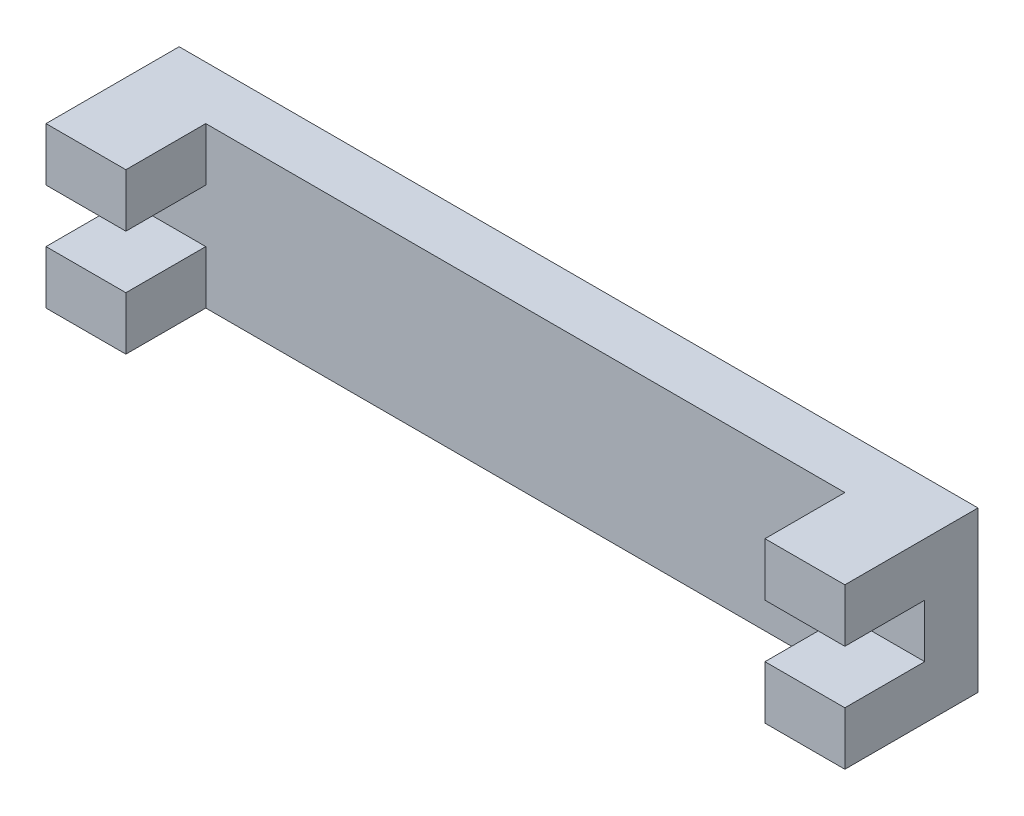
ISO-10303-21;
HEADER;
FILE_DESCRIPTION(('STEP AP214'),'2;1');
FILE_NAME('part.step','',(''),(''),'','','');
FILE_SCHEMA(('AUTOMOTIVE_DESIGN { 1 0 10303 214 1 1 1 1 }'));
ENDSEC;
DATA;
#1=APPLICATION_CONTEXT('core data for automotive mechanical design processes');
#2=APPLICATION_PROTOCOL_DEFINITION('international standard','automotive_design',2000,#1);
#3=PRODUCT_CONTEXT('',#1,'mechanical');
#4=PRODUCT('Part','Part','',(#3));
#5=PRODUCT_RELATED_PRODUCT_CATEGORY('part','',(#4));
#6=PRODUCT_DEFINITION_FORMATION('','',#4);
#7=PRODUCT_DEFINITION_CONTEXT('part definition',#1,'design');
#8=PRODUCT_DEFINITION('design','',#6,#7);
#9=PRODUCT_DEFINITION_SHAPE('','',#8);
#10=(LENGTH_UNIT() NAMED_UNIT(*) SI_UNIT(.MILLI.,.METRE.));
#11=(NAMED_UNIT(*) PLANE_ANGLE_UNIT() SI_UNIT($,.RADIAN.));
#12=(NAMED_UNIT(*) SI_UNIT($,.STERADIAN.) SOLID_ANGLE_UNIT());
#13=UNCERTAINTY_MEASURE_WITH_UNIT(LENGTH_MEASURE(1.E-05),#10,'distance_accuracy_value','');
#14=(GEOMETRIC_REPRESENTATION_CONTEXT(3) GLOBAL_UNCERTAINTY_ASSIGNED_CONTEXT((#13)) GLOBAL_UNIT_ASSIGNED_CONTEXT((#10,
#11,#12)) REPRESENTATION_CONTEXT('',''));
#15=CARTESIAN_POINT('',(0.,0.,0.));
#16=DIRECTION('',(0.,0.,1.));
#17=DIRECTION('',(1.,0.,0.));
#18=AXIS2_PLACEMENT_3D('',#15,#16,#17);
#19=CARTESIAN_POINT('',(0.,0.,2.));
#20=DIRECTION('',(0.,0.,-1.));
#21=DIRECTION('',(-1.,0.,0.));
#22=AXIS2_PLACEMENT_3D('',#19,#20,#21);
#23=PLANE('',#22);
#24=DIRECTION('',(1.,0.,0.));
#25=VECTOR('',#24,1.);
#26=CARTESIAN_POINT('',(30.,4.,2.));
#27=LINE('',#26,#25);
#28=CARTESIAN_POINT('',(27.,4.,2.));
#29=VERTEX_POINT('',#28);
#30=CARTESIAN_POINT('',(30.,4.,2.));
#31=VERTEX_POINT('',#30);
#32=EDGE_CURVE('E248',#29,#31,#27,.T.);
#33=ORIENTED_EDGE('',*,*,#32,.F.);
#34=DIRECTION('',(0.,-1.,0.));
#35=VECTOR('',#34,1.);
#36=CARTESIAN_POINT('',(27.,6.,2.));
#37=LINE('',#36,#35);
#38=CARTESIAN_POINT('',(27.,6.,2.));
#39=VERTEX_POINT('',#38);
#40=EDGE_CURVE('E66',#39,#29,#37,.T.);
#41=ORIENTED_EDGE('',*,*,#40,.F.);
#42=DIRECTION('',(-1.,0.,0.));
#43=VECTOR('',#42,1.);
#44=CARTESIAN_POINT('',(0.,6.,2.));
#45=LINE('',#44,#43);
#46=CARTESIAN_POINT('',(3.,6.,2.));
#47=VERTEX_POINT('',#46);
#48=EDGE_CURVE('E61',#39,#47,#45,.T.);
#49=ORIENTED_EDGE('',*,*,#48,.T.);
#50=DIRECTION('',(0.,1.,0.));
#51=VECTOR('',#50,1.);
#52=CARTESIAN_POINT('',(3.,6.,2.));
#53=LINE('',#52,#51);
#54=CARTESIAN_POINT('',(3.,4.,2.));
#55=VERTEX_POINT('',#54);
#56=EDGE_CURVE('E271',#55,#47,#53,.T.);
#57=ORIENTED_EDGE('',*,*,#56,.F.);
#58=DIRECTION('',(1.,0.,0.));
#59=VECTOR('',#58,1.);
#60=CARTESIAN_POINT('',(0.,4.,2.));
#61=LINE('',#60,#59);
#62=CARTESIAN_POINT('',(0.,4.,2.));
#63=VERTEX_POINT('',#62);
#64=EDGE_CURVE('E178',#63,#55,#61,.T.);
#65=ORIENTED_EDGE('',*,*,#64,.F.);
#66=DIRECTION('',(0.,-1.,0.));
#67=VECTOR('',#66,1.);
#68=CARTESIAN_POINT('',(0.,0.,2.));
#69=LINE('',#68,#67);
#70=CARTESIAN_POINT('',(0.,2.,2.));
#71=VERTEX_POINT('',#70);
#72=EDGE_CURVE('E160',#63,#71,#69,.T.);
#73=ORIENTED_EDGE('',*,*,#72,.T.);
#74=DIRECTION('',(-1.,0.,0.));
#75=VECTOR('',#74,1.);
#76=CARTESIAN_POINT('',(0.,2.,2.));
#77=LINE('',#76,#75);
#78=CARTESIAN_POINT('',(3.,2.,2.));
#79=VERTEX_POINT('',#78);
#80=EDGE_CURVE('E155',#79,#71,#77,.T.);
#81=ORIENTED_EDGE('',*,*,#80,.F.);
#82=DIRECTION('',(0.,1.,0.));
#83=VECTOR('',#82,1.);
#84=CARTESIAN_POINT('',(3.,0.,2.));
#85=LINE('',#84,#83);
#86=CARTESIAN_POINT('',(3.,0.,2.));
#87=VERTEX_POINT('',#86);
#88=EDGE_CURVE('E157',#87,#79,#85,.T.);
#89=ORIENTED_EDGE('',*,*,#88,.F.);
#90=DIRECTION('',(1.,0.,0.));
#91=VECTOR('',#90,1.);
#92=CARTESIAN_POINT('',(0.,0.,2.));
#93=LINE('',#92,#91);
#94=CARTESIAN_POINT('',(27.,0.,2.));
#95=VERTEX_POINT('',#94);
#96=EDGE_CURVE('E301',#87,#95,#93,.T.);
#97=ORIENTED_EDGE('',*,*,#96,.T.);
#98=DIRECTION('',(0.,-1.,0.));
#99=VECTOR('',#98,1.);
#100=CARTESIAN_POINT('',(27.,0.,2.));
#101=LINE('',#100,#99);
#102=CARTESIAN_POINT('',(27.,2.,2.));
#103=VERTEX_POINT('',#102);
#104=EDGE_CURVE('E215',#103,#95,#101,.T.);
#105=ORIENTED_EDGE('',*,*,#104,.F.);
#106=DIRECTION('',(-1.,0.,0.));
#107=VECTOR('',#106,1.);
#108=CARTESIAN_POINT('',(30.,2.,2.));
#109=LINE('',#108,#107);
#110=CARTESIAN_POINT('',(30.,2.,2.));
#111=VERTEX_POINT('',#110);
#112=EDGE_CURVE('E188',#111,#103,#109,.T.);
#113=ORIENTED_EDGE('',*,*,#112,.F.);
#114=DIRECTION('',(0.,1.,0.));
#115=VECTOR('',#114,1.);
#116=CARTESIAN_POINT('',(30.,0.,2.));
#117=LINE('',#116,#115);
#118=EDGE_CURVE('E305',#111,#31,#117,.T.);
#119=ORIENTED_EDGE('',*,*,#118,.T.);
#120=EDGE_LOOP('',(#33,#41,#49,#57,#65,#73,#81,#89,#97,#105,#113,#119));
#121=FACE_BOUND('',#120,.T.);
#122=ADVANCED_FACE('F45',(#121),#23,.F.);
#123=CARTESIAN_POINT('',(0.,0.,2.));
#124=DIRECTION('',(1.,0.,0.));
#125=DIRECTION('',(0.,0.,-1.));
#126=AXIS2_PLACEMENT_3D('',#123,#124,#125);
#127=PLANE('',#126);
#128=DIRECTION('',(0.,-1.,0.));
#129=VECTOR('',#128,1.);
#130=CARTESIAN_POINT('',(0.,0.,0.));
#131=LINE('',#130,#129);
#132=CARTESIAN_POINT('',(0.,6.,0.));
#133=VERTEX_POINT('',#132);
#134=CARTESIAN_POINT('',(0.,0.,0.));
#135=VERTEX_POINT('',#134);
#136=EDGE_CURVE('E298',#133,#135,#131,.T.);
#137=ORIENTED_EDGE('',*,*,#136,.T.);
#138=DIRECTION('',(0.,0.,-1.));
#139=VECTOR('',#138,1.);
#140=CARTESIAN_POINT('',(0.,0.,2.));
#141=LINE('',#140,#139);
#142=CARTESIAN_POINT('',(0.,0.,5.));
#143=VERTEX_POINT('',#142);
#144=EDGE_CURVE('E11',#143,#135,#141,.T.);
#145=ORIENTED_EDGE('',*,*,#144,.F.);
#146=DIRECTION('',(0.,-1.,0.));
#147=VECTOR('',#146,1.);
#148=CARTESIAN_POINT('',(0.,0.,5.));
#149=LINE('',#148,#147);
#150=CARTESIAN_POINT('',(0.,2.,5.));
#151=VERTEX_POINT('',#150);
#152=EDGE_CURVE('E166',#151,#143,#149,.T.);
#153=ORIENTED_EDGE('',*,*,#152,.F.);
#154=DIRECTION('',(0.,0.,-1.));
#155=VECTOR('',#154,1.);
#156=CARTESIAN_POINT('',(0.,2.,5.));
#157=LINE('',#156,#155);
#158=EDGE_CURVE('E183',#151,#71,#157,.T.);
#159=ORIENTED_EDGE('',*,*,#158,.T.);
#160=ORIENTED_EDGE('',*,*,#72,.F.);
#161=DIRECTION('',(0.,0.,-1.));
#162=VECTOR('',#161,1.);
#163=CARTESIAN_POINT('',(0.,4.,5.));
#164=LINE('',#163,#162);
#165=CARTESIAN_POINT('',(0.,4.,5.));
#166=VERTEX_POINT('',#165);
#167=EDGE_CURVE('E294',#166,#63,#164,.T.);
#168=ORIENTED_EDGE('',*,*,#167,.F.);
#169=DIRECTION('',(0.,-1.,0.));
#170=VECTOR('',#169,1.);
#171=CARTESIAN_POINT('',(0.,6.,5.));
#172=LINE('',#171,#170);
#173=CARTESIAN_POINT('',(0.,6.,5.));
#174=VERTEX_POINT('',#173);
#175=EDGE_CURVE('E266',#174,#166,#172,.T.);
#176=ORIENTED_EDGE('',*,*,#175,.F.);
#177=DIRECTION('',(0.,0.,-1.));
#178=VECTOR('',#177,1.);
#179=CARTESIAN_POINT('',(0.,6.,2.));
#180=LINE('',#179,#178);
#181=EDGE_CURVE('E310',#174,#133,#180,.T.);
#182=ORIENTED_EDGE('',*,*,#181,.T.);
#183=EDGE_LOOP('',(#137,#145,#153,#159,#160,#168,#176,#182));
#184=FACE_BOUND('',#183,.T.);
#185=ADVANCED_FACE('F47',(#184),#127,.F.);
#186=CARTESIAN_POINT('',(0.,0.,2.));
#187=DIRECTION('',(0.,1.,0.));
#188=DIRECTION('',(0.,0.,1.));
#189=AXIS2_PLACEMENT_3D('',#186,#187,#188);
#190=PLANE('',#189);
#191=DIRECTION('',(1.,0.,0.));
#192=VECTOR('',#191,1.);
#193=CARTESIAN_POINT('',(0.,0.,0.));
#194=LINE('',#193,#192);
#195=CARTESIAN_POINT('',(30.,0.,0.));
#196=VERTEX_POINT('',#195);
#197=EDGE_CURVE('E314',#135,#196,#194,.T.);
#198=ORIENTED_EDGE('',*,*,#197,.T.);
#199=DIRECTION('',(0.,0.,-1.));
#200=VECTOR('',#199,1.);
#201=CARTESIAN_POINT('',(30.,0.,2.));
#202=LINE('',#201,#200);
#203=CARTESIAN_POINT('',(30.,0.,5.));
#204=VERTEX_POINT('',#203);
#205=EDGE_CURVE('E54',#204,#196,#202,.T.);
#206=ORIENTED_EDGE('',*,*,#205,.F.);
#207=DIRECTION('',(1.,0.,0.));
#208=VECTOR('',#207,1.);
#209=CARTESIAN_POINT('',(30.,0.,5.));
#210=LINE('',#209,#208);
#211=CARTESIAN_POINT('',(27.,0.,5.));
#212=VERTEX_POINT('',#211);
#213=EDGE_CURVE('E214',#212,#204,#210,.T.);
#214=ORIENTED_EDGE('',*,*,#213,.F.);
#215=DIRECTION('',(0.,0.,-1.));
#216=VECTOR('',#215,1.);
#217=CARTESIAN_POINT('',(27.,0.,5.));
#218=LINE('',#217,#216);
#219=EDGE_CURVE('E210',#212,#95,#218,.T.);
#220=ORIENTED_EDGE('',*,*,#219,.T.);
#221=ORIENTED_EDGE('',*,*,#96,.F.);
#222=DIRECTION('',(0.,0.,-1.));
#223=VECTOR('',#222,1.);
#224=CARTESIAN_POINT('',(3.,0.,5.));
#225=LINE('',#224,#223);
#226=CARTESIAN_POINT('',(3.,0.,5.));
#227=VERTEX_POINT('',#226);
#228=EDGE_CURVE('E176',#227,#87,#225,.T.);
#229=ORIENTED_EDGE('',*,*,#228,.F.);
#230=DIRECTION('',(1.,0.,0.));
#231=VECTOR('',#230,1.);
#232=CARTESIAN_POINT('',(0.,0.,5.));
#233=LINE('',#232,#231);
#234=EDGE_CURVE('E196',#143,#227,#233,.T.);
#235=ORIENTED_EDGE('',*,*,#234,.F.);
#236=ORIENTED_EDGE('',*,*,#144,.T.);
#237=EDGE_LOOP('',(#198,#206,#214,#220,#221,#229,#235,#236));
#238=FACE_BOUND('',#237,.T.);
#239=ADVANCED_FACE('F372',(#238),#190,.F.);
#240=CARTESIAN_POINT('',(30.,0.,2.));
#241=DIRECTION('',(-1.,0.,0.));
#242=DIRECTION('',(0.,0.,1.));
#243=AXIS2_PLACEMENT_3D('',#240,#241,#242);
#244=PLANE('',#243);
#245=DIRECTION('',(0.,1.,0.));
#246=VECTOR('',#245,1.);
#247=CARTESIAN_POINT('',(30.,0.,0.));
#248=LINE('',#247,#246);
#249=CARTESIAN_POINT('',(30.,6.,0.));
#250=VERTEX_POINT('',#249);
#251=EDGE_CURVE('E317',#196,#250,#248,.T.);
#252=ORIENTED_EDGE('',*,*,#251,.T.);
#253=DIRECTION('',(0.,0.,-1.));
#254=VECTOR('',#253,1.);
#255=CARTESIAN_POINT('',(30.,6.,2.));
#256=LINE('',#255,#254);
#257=CARTESIAN_POINT('',(30.,6.,5.));
#258=VERTEX_POINT('',#257);
#259=EDGE_CURVE('E325',#258,#250,#256,.T.);
#260=ORIENTED_EDGE('',*,*,#259,.F.);
#261=DIRECTION('',(0.,1.,0.));
#262=VECTOR('',#261,1.);
#263=CARTESIAN_POINT('',(30.,6.,5.));
#264=LINE('',#263,#262);
#265=CARTESIAN_POINT('',(30.,4.,5.));
#266=VERTEX_POINT('',#265);
#267=EDGE_CURVE('E252',#266,#258,#264,.T.);
#268=ORIENTED_EDGE('',*,*,#267,.F.);
#269=DIRECTION('',(0.,0.,-1.));
#270=VECTOR('',#269,1.);
#271=CARTESIAN_POINT('',(30.,4.,5.));
#272=LINE('',#271,#270);
#273=EDGE_CURVE('E243',#266,#31,#272,.T.);
#274=ORIENTED_EDGE('',*,*,#273,.T.);
#275=ORIENTED_EDGE('',*,*,#118,.F.);
#276=DIRECTION('',(0.,0.,-1.));
#277=VECTOR('',#276,1.);
#278=CARTESIAN_POINT('',(30.,2.,5.));
#279=LINE('',#278,#277);
#280=CARTESIAN_POINT('',(30.,2.,5.));
#281=VERTEX_POINT('',#280);
#282=EDGE_CURVE('E202',#281,#111,#279,.T.);
#283=ORIENTED_EDGE('',*,*,#282,.F.);
#284=DIRECTION('',(0.,1.,0.));
#285=VECTOR('',#284,1.);
#286=CARTESIAN_POINT('',(30.,0.,5.));
#287=LINE('',#286,#285);
#288=EDGE_CURVE('E219',#204,#281,#287,.T.);
#289=ORIENTED_EDGE('',*,*,#288,.F.);
#290=ORIENTED_EDGE('',*,*,#205,.T.);
#291=EDGE_LOOP('',(#252,#260,#268,#274,#275,#283,#289,#290));
#292=FACE_BOUND('',#291,.T.);
#293=ADVANCED_FACE('F333',(#292),#244,.F.);
#294=CARTESIAN_POINT('',(0.,6.,2.));
#295=DIRECTION('',(0.,-1.,0.));
#296=DIRECTION('',(0.,0.,-1.));
#297=AXIS2_PLACEMENT_3D('',#294,#295,#296);
#298=PLANE('',#297);
#299=DIRECTION('',(-1.,0.,0.));
#300=VECTOR('',#299,1.);
#301=CARTESIAN_POINT('',(0.,6.,0.));
#302=LINE('',#301,#300);
#303=EDGE_CURVE('E302',#250,#133,#302,.T.);
#304=ORIENTED_EDGE('',*,*,#303,.T.);
#305=ORIENTED_EDGE('',*,*,#181,.F.);
#306=DIRECTION('',(-1.,0.,0.));
#307=VECTOR('',#306,1.);
#308=CARTESIAN_POINT('',(0.,6.,5.));
#309=LINE('',#308,#307);
#310=CARTESIAN_POINT('',(3.,6.,5.));
#311=VERTEX_POINT('',#310);
#312=EDGE_CURVE('E277',#311,#174,#309,.T.);
#313=ORIENTED_EDGE('',*,*,#312,.F.);
#314=DIRECTION('',(0.,0.,-1.));
#315=VECTOR('',#314,1.);
#316=CARTESIAN_POINT('',(3.,6.,5.));
#317=LINE('',#316,#315);
#318=EDGE_CURVE('E281',#311,#47,#317,.T.);
#319=ORIENTED_EDGE('',*,*,#318,.T.);
#320=ORIENTED_EDGE('',*,*,#48,.F.);
#321=DIRECTION('',(0.,0.,-1.));
#322=VECTOR('',#321,1.);
#323=CARTESIAN_POINT('',(27.,6.,5.));
#324=LINE('',#323,#322);
#325=CARTESIAN_POINT('',(27.,6.,5.));
#326=VERTEX_POINT('',#325);
#327=EDGE_CURVE('E235',#326,#39,#324,.T.);
#328=ORIENTED_EDGE('',*,*,#327,.F.);
#329=DIRECTION('',(-1.,0.,0.));
#330=VECTOR('',#329,1.);
#331=CARTESIAN_POINT('',(30.,6.,5.));
#332=LINE('',#331,#330);
#333=EDGE_CURVE('E260',#258,#326,#332,.T.);
#334=ORIENTED_EDGE('',*,*,#333,.F.);
#335=ORIENTED_EDGE('',*,*,#259,.T.);
#336=EDGE_LOOP('',(#304,#305,#313,#319,#320,#328,#334,#335));
#337=FACE_BOUND('',#336,.T.);
#338=ADVANCED_FACE('F342',(#337),#298,.F.);
#339=CARTESIAN_POINT('',(0.,0.,0.));
#340=DIRECTION('',(0.,0.,-1.));
#341=DIRECTION('',(-1.,0.,0.));
#342=AXIS2_PLACEMENT_3D('',#339,#340,#341);
#343=PLANE('',#342);
#344=ORIENTED_EDGE('',*,*,#136,.F.);
#345=ORIENTED_EDGE('',*,*,#303,.F.);
#346=ORIENTED_EDGE('',*,*,#251,.F.);
#347=ORIENTED_EDGE('',*,*,#197,.F.);
#348=EDGE_LOOP('',(#344,#345,#346,#347));
#349=FACE_BOUND('',#348,.T.);
#350=ADVANCED_FACE('F340',(#349),#343,.T.);
#351=CARTESIAN_POINT('',(0.,4.,5.));
#352=DIRECTION('',(0.,1.,0.));
#353=DIRECTION('',(0.,0.,1.));
#354=AXIS2_PLACEMENT_3D('',#351,#352,#353);
#355=PLANE('',#354);
#356=ORIENTED_EDGE('',*,*,#64,.T.);
#357=DIRECTION('',(0.,0.,-1.));
#358=VECTOR('',#357,1.);
#359=CARTESIAN_POINT('',(3.,4.,5.));
#360=LINE('',#359,#358);
#361=CARTESIAN_POINT('',(3.,4.,5.));
#362=VERTEX_POINT('',#361);
#363=EDGE_CURVE('E290',#362,#55,#360,.T.);
#364=ORIENTED_EDGE('',*,*,#363,.F.);
#365=DIRECTION('',(1.,0.,0.));
#366=VECTOR('',#365,1.);
#367=CARTESIAN_POINT('',(0.,4.,5.));
#368=LINE('',#367,#366);
#369=EDGE_CURVE('E270',#166,#362,#368,.T.);
#370=ORIENTED_EDGE('',*,*,#369,.F.);
#371=ORIENTED_EDGE('',*,*,#167,.T.);
#372=EDGE_LOOP('',(#356,#364,#370,#371));
#373=FACE_BOUND('',#372,.T.);
#374=ADVANCED_FACE('F357',(#373),#355,.F.);
#375=CARTESIAN_POINT('',(3.,6.,5.));
#376=DIRECTION('',(-1.,0.,0.));
#377=DIRECTION('',(0.,-1.,0.));
#378=AXIS2_PLACEMENT_3D('',#375,#376,#377);
#379=PLANE('',#378);
#380=ORIENTED_EDGE('',*,*,#56,.T.);
#381=ORIENTED_EDGE('',*,*,#318,.F.);
#382=DIRECTION('',(0.,1.,0.));
#383=VECTOR('',#382,1.);
#384=CARTESIAN_POINT('',(3.,6.,5.));
#385=LINE('',#384,#383);
#386=EDGE_CURVE('E274',#362,#311,#385,.T.);
#387=ORIENTED_EDGE('',*,*,#386,.F.);
#388=ORIENTED_EDGE('',*,*,#363,.T.);
#389=EDGE_LOOP('',(#380,#381,#387,#388));
#390=FACE_BOUND('',#389,.T.);
#391=ADVANCED_FACE('F355',(#390),#379,.F.);
#392=CARTESIAN_POINT('',(0.,0.,5.));
#393=DIRECTION('',(0.,0.,1.));
#394=DIRECTION('',(1.,0.,0.));
#395=AXIS2_PLACEMENT_3D('',#392,#393,#394);
#396=PLANE('',#395);
#397=ORIENTED_EDGE('',*,*,#175,.T.);
#398=ORIENTED_EDGE('',*,*,#369,.T.);
#399=ORIENTED_EDGE('',*,*,#386,.T.);
#400=ORIENTED_EDGE('',*,*,#312,.T.);
#401=EDGE_LOOP('',(#397,#398,#399,#400));
#402=FACE_BOUND('',#401,.T.);
#403=ADVANCED_FACE('F349',(#402),#396,.T.);
#404=CARTESIAN_POINT('',(3.,0.,5.));
#405=DIRECTION('',(-1.,0.,0.));
#406=DIRECTION('',(0.,0.,1.));
#407=AXIS2_PLACEMENT_3D('',#404,#405,#406);
#408=PLANE('',#407);
#409=ORIENTED_EDGE('',*,*,#88,.T.);
#410=DIRECTION('',(0.,0.,-1.));
#411=VECTOR('',#410,1.);
#412=CARTESIAN_POINT('',(3.,2.,5.));
#413=LINE('',#412,#411);
#414=CARTESIAN_POINT('',(3.,2.,5.));
#415=VERTEX_POINT('',#414);
#416=EDGE_CURVE('E173',#415,#79,#413,.T.);
#417=ORIENTED_EDGE('',*,*,#416,.F.);
#418=DIRECTION('',(0.,1.,0.));
#419=VECTOR('',#418,1.);
#420=CARTESIAN_POINT('',(3.,0.,5.));
#421=LINE('',#420,#419);
#422=EDGE_CURVE('E193',#227,#415,#421,.T.);
#423=ORIENTED_EDGE('',*,*,#422,.F.);
#424=ORIENTED_EDGE('',*,*,#228,.T.);
#425=EDGE_LOOP('',(#409,#417,#423,#424));
#426=FACE_BOUND('',#425,.T.);
#427=ADVANCED_FACE('F171',(#426),#408,.F.);
#428=CARTESIAN_POINT('',(0.,2.,5.));
#429=DIRECTION('',(0.,-1.,0.));
#430=DIRECTION('',(0.,0.,-1.));
#431=AXIS2_PLACEMENT_3D('',#428,#429,#430);
#432=PLANE('',#431);
#433=ORIENTED_EDGE('',*,*,#80,.T.);
#434=ORIENTED_EDGE('',*,*,#158,.F.);
#435=DIRECTION('',(-1.,0.,0.));
#436=VECTOR('',#435,1.);
#437=CARTESIAN_POINT('',(0.,2.,5.));
#438=LINE('',#437,#436);
#439=EDGE_CURVE('E181',#415,#151,#438,.T.);
#440=ORIENTED_EDGE('',*,*,#439,.F.);
#441=ORIENTED_EDGE('',*,*,#416,.T.);
#442=EDGE_LOOP('',(#433,#434,#440,#441));
#443=FACE_BOUND('',#442,.T.);
#444=ADVANCED_FACE('F180',(#443),#432,.F.);
#445=CARTESIAN_POINT('',(0.,0.,5.));
#446=DIRECTION('',(0.,0.,-1.));
#447=DIRECTION('',(-1.,0.,0.));
#448=AXIS2_PLACEMENT_3D('',#445,#446,#447);
#449=PLANE('',#448);
#450=ORIENTED_EDGE('',*,*,#152,.T.);
#451=ORIENTED_EDGE('',*,*,#234,.T.);
#452=ORIENTED_EDGE('',*,*,#422,.T.);
#453=ORIENTED_EDGE('',*,*,#439,.T.);
#454=EDGE_LOOP('',(#450,#451,#452,#453));
#455=FACE_BOUND('',#454,.T.);
#456=ADVANCED_FACE('F382',(#455),#449,.F.);
#457=CARTESIAN_POINT('',(30.,2.,5.));
#458=DIRECTION('',(0.,-1.,0.));
#459=DIRECTION('',(0.,0.,-1.));
#460=AXIS2_PLACEMENT_3D('',#457,#458,#459);
#461=PLANE('',#460);
#462=ORIENTED_EDGE('',*,*,#112,.T.);
#463=DIRECTION('',(0.,0.,-1.));
#464=VECTOR('',#463,1.);
#465=CARTESIAN_POINT('',(27.,2.,5.));
#466=LINE('',#465,#464);
#467=CARTESIAN_POINT('',(27.,2.,5.));
#468=VERTEX_POINT('',#467);
#469=EDGE_CURVE('E206',#468,#103,#466,.T.);
#470=ORIENTED_EDGE('',*,*,#469,.F.);
#471=DIRECTION('',(-1.,0.,0.));
#472=VECTOR('',#471,1.);
#473=CARTESIAN_POINT('',(30.,2.,5.));
#474=LINE('',#473,#472);
#475=EDGE_CURVE('E229',#281,#468,#474,.T.);
#476=ORIENTED_EDGE('',*,*,#475,.F.);
#477=ORIENTED_EDGE('',*,*,#282,.T.);
#478=EDGE_LOOP('',(#462,#470,#476,#477));
#479=FACE_BOUND('',#478,.T.);
#480=ADVANCED_FACE('F389',(#479),#461,.F.);
#481=CARTESIAN_POINT('',(27.,0.,5.));
#482=DIRECTION('',(1.,0.,0.));
#483=DIRECTION('',(0.,0.,-1.));
#484=AXIS2_PLACEMENT_3D('',#481,#482,#483);
#485=PLANE('',#484);
#486=ORIENTED_EDGE('',*,*,#104,.T.);
#487=ORIENTED_EDGE('',*,*,#219,.F.);
#488=DIRECTION('',(0.,-1.,0.));
#489=VECTOR('',#488,1.);
#490=CARTESIAN_POINT('',(27.,0.,5.));
#491=LINE('',#490,#489);
#492=EDGE_CURVE('E226',#468,#212,#491,.T.);
#493=ORIENTED_EDGE('',*,*,#492,.F.);
#494=ORIENTED_EDGE('',*,*,#469,.T.);
#495=EDGE_LOOP('',(#486,#487,#493,#494));
#496=FACE_BOUND('',#495,.T.);
#497=ADVANCED_FACE('F385',(#496),#485,.F.);
#498=CARTESIAN_POINT('',(0.,0.,5.));
#499=DIRECTION('',(0.,0.,1.));
#500=DIRECTION('',(1.,0.,0.));
#501=AXIS2_PLACEMENT_3D('',#498,#499,#500);
#502=PLANE('',#501);
#503=ORIENTED_EDGE('',*,*,#288,.T.);
#504=ORIENTED_EDGE('',*,*,#475,.T.);
#505=ORIENTED_EDGE('',*,*,#492,.T.);
#506=ORIENTED_EDGE('',*,*,#213,.T.);
#507=EDGE_LOOP('',(#503,#504,#505,#506));
#508=FACE_BOUND('',#507,.T.);
#509=ADVANCED_FACE('F426',(#508),#502,.T.);
#510=CARTESIAN_POINT('',(27.,6.,5.));
#511=DIRECTION('',(1.,0.,0.));
#512=DIRECTION('',(0.,1.,0.));
#513=AXIS2_PLACEMENT_3D('',#510,#511,#512);
#514=PLANE('',#513);
#515=ORIENTED_EDGE('',*,*,#40,.T.);
#516=DIRECTION('',(0.,0.,-1.));
#517=VECTOR('',#516,1.);
#518=CARTESIAN_POINT('',(27.,4.,5.));
#519=LINE('',#518,#517);
#520=CARTESIAN_POINT('',(27.,4.,5.));
#521=VERTEX_POINT('',#520);
#522=EDGE_CURVE('E239',#521,#29,#519,.T.);
#523=ORIENTED_EDGE('',*,*,#522,.F.);
#524=DIRECTION('',(0.,-1.,0.));
#525=VECTOR('',#524,1.);
#526=CARTESIAN_POINT('',(27.,6.,5.));
#527=LINE('',#526,#525);
#528=EDGE_CURVE('E257',#326,#521,#527,.T.);
#529=ORIENTED_EDGE('',*,*,#528,.F.);
#530=ORIENTED_EDGE('',*,*,#327,.T.);
#531=EDGE_LOOP('',(#515,#523,#529,#530));
#532=FACE_BOUND('',#531,.T.);
#533=ADVANCED_FACE('F398',(#532),#514,.F.);
#534=CARTESIAN_POINT('',(30.,4.,5.));
#535=DIRECTION('',(0.,1.,0.));
#536=DIRECTION('',(0.,0.,1.));
#537=AXIS2_PLACEMENT_3D('',#534,#535,#536);
#538=PLANE('',#537);
#539=ORIENTED_EDGE('',*,*,#32,.T.);
#540=ORIENTED_EDGE('',*,*,#273,.F.);
#541=DIRECTION('',(1.,0.,0.));
#542=VECTOR('',#541,1.);
#543=CARTESIAN_POINT('',(30.,4.,5.));
#544=LINE('',#543,#542);
#545=EDGE_CURVE('E247',#521,#266,#544,.T.);
#546=ORIENTED_EDGE('',*,*,#545,.F.);
#547=ORIENTED_EDGE('',*,*,#522,.T.);
#548=EDGE_LOOP('',(#539,#540,#546,#547));
#549=FACE_BOUND('',#548,.T.);
#550=ADVANCED_FACE('F395',(#549),#538,.F.);
#551=CARTESIAN_POINT('',(0.,0.,5.));
#552=DIRECTION('',(0.,0.,-1.));
#553=DIRECTION('',(-1.,0.,0.));
#554=AXIS2_PLACEMENT_3D('',#551,#552,#553);
#555=PLANE('',#554);
#556=ORIENTED_EDGE('',*,*,#267,.T.);
#557=ORIENTED_EDGE('',*,*,#333,.T.);
#558=ORIENTED_EDGE('',*,*,#528,.T.);
#559=ORIENTED_EDGE('',*,*,#545,.T.);
#560=EDGE_LOOP('',(#556,#557,#558,#559));
#561=FACE_BOUND('',#560,.T.);
#562=ADVANCED_FACE('F401',(#561),#555,.F.);
#563=CLOSED_SHELL('',(#122,#185,#239,#293,#338,#350,#374,#391,#403,#427,#444,#456,#480,#497,
#509,#533,#550,#562));
#564=MANIFOLD_SOLID_BREP('B2',#563);
#565=ADVANCED_BREP_SHAPE_REPRESENTATION('',(#18,#564),#14);
#566=SHAPE_DEFINITION_REPRESENTATION(#9,#565);
ENDSEC;
END-ISO-10303-21;
